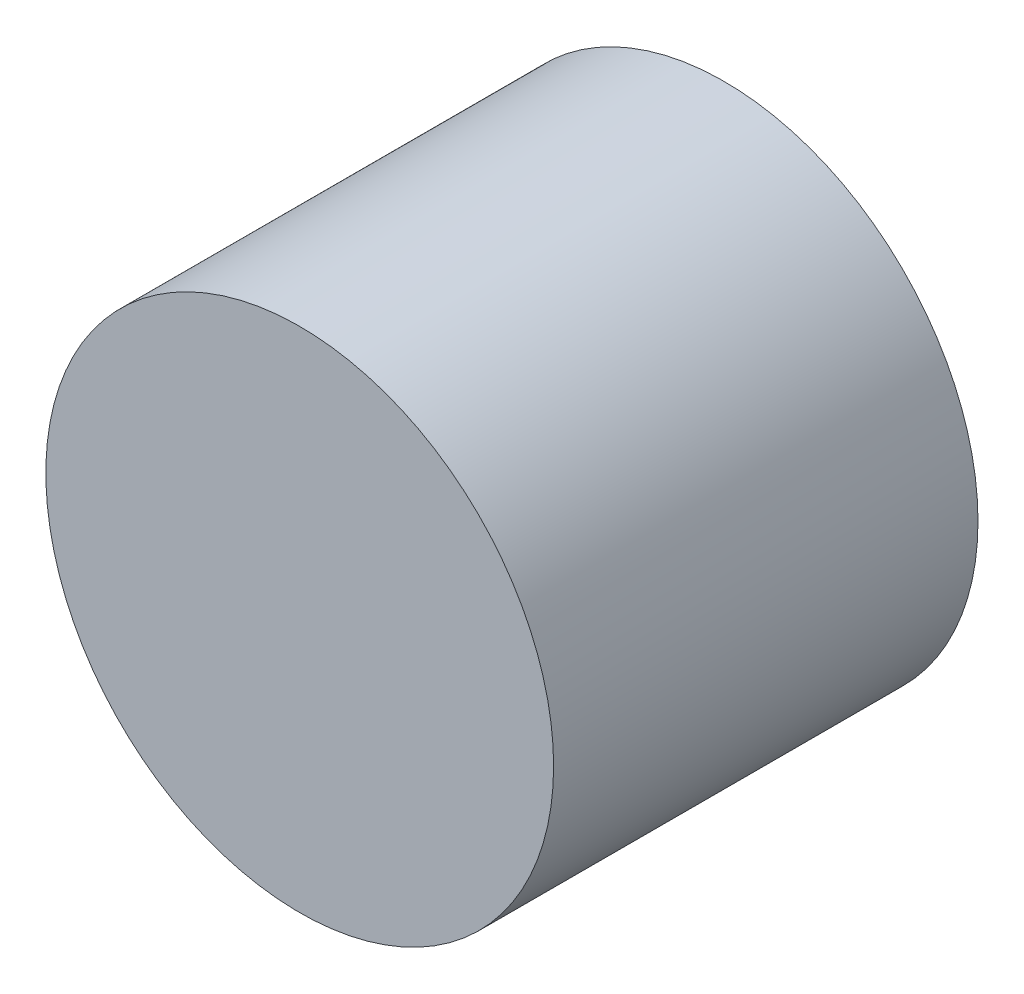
from build123d import *

# Parameters (mm, degrees)
ESQUISSE1_R             = 7.777414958
BOSS_EXTRU_1_DEPTH      = 15
ESQUISSE2_R             = 7.777414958
ENL_V_MAT_EXTRU_1_DEPTH = 2


with BuildPart() as part:
    # Esquisse1 → Boss.-Extru.1 (new body)
    with BuildSketch(Plane.XY):
        with Locations((132, 0)):
            Circle(ESQUISSE1_R)
    extrude(amount=-BOSS_EXTRU_1_DEPTH)

    # Esquisse2 → Enl_v. mat.-Extru.1 (cut)
    with BuildSketch(Plane.XY):
        with Locations((132, 0)):
            Circle(ESQUISSE2_R)
    extrude(amount=-ENL_V_MAT_EXTRU_1_DEPTH, mode=Mode.SUBTRACT)


solid = part.part
